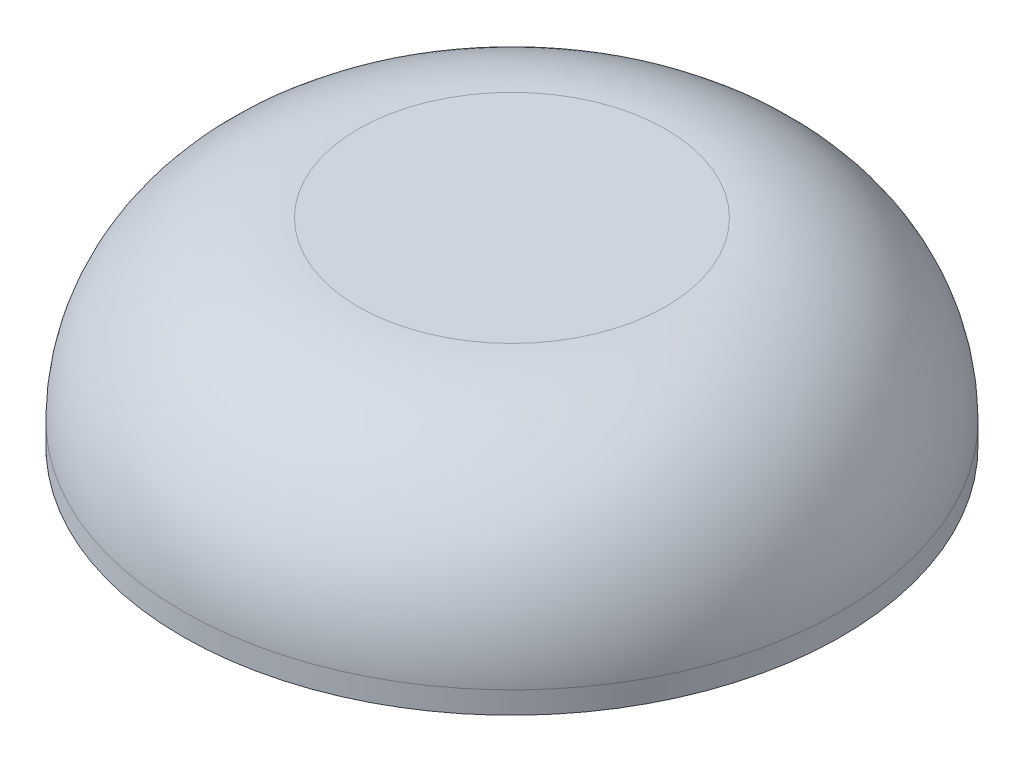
ISO-10303-21;
HEADER;
FILE_DESCRIPTION(('STEP AP214'),'2;1');
FILE_NAME('part.step','',(''),(''),'','','');
FILE_SCHEMA(('AUTOMOTIVE_DESIGN { 1 0 10303 214 1 1 1 1 }'));
ENDSEC;
DATA;
#1=APPLICATION_CONTEXT('core data for automotive mechanical design processes');
#2=APPLICATION_PROTOCOL_DEFINITION('international standard','automotive_design',2000,#1);
#3=PRODUCT_CONTEXT('',#1,'mechanical');
#4=PRODUCT('Part','Part','',(#3));
#5=PRODUCT_RELATED_PRODUCT_CATEGORY('part','',(#4));
#6=PRODUCT_DEFINITION_FORMATION('','',#4);
#7=PRODUCT_DEFINITION_CONTEXT('part definition',#1,'design');
#8=PRODUCT_DEFINITION('design','',#6,#7);
#9=PRODUCT_DEFINITION_SHAPE('','',#8);
#10=(LENGTH_UNIT() NAMED_UNIT(*) SI_UNIT(.MILLI.,.METRE.));
#11=(NAMED_UNIT(*) PLANE_ANGLE_UNIT() SI_UNIT($,.RADIAN.));
#12=(NAMED_UNIT(*) SI_UNIT($,.STERADIAN.) SOLID_ANGLE_UNIT());
#13=UNCERTAINTY_MEASURE_WITH_UNIT(LENGTH_MEASURE(1.E-05),#10,'distance_accuracy_value','');
#14=(GEOMETRIC_REPRESENTATION_CONTEXT(3) GLOBAL_UNCERTAINTY_ASSIGNED_CONTEXT((#13)) GLOBAL_UNIT_ASSIGNED_CONTEXT((#10,
#11,#12)) REPRESENTATION_CONTEXT('',''));
#15=CARTESIAN_POINT('',(0.,0.,0.));
#16=DIRECTION('',(0.,0.,1.));
#17=DIRECTION('',(1.,0.,0.));
#18=AXIS2_PLACEMENT_3D('',#15,#16,#17);
#19=CARTESIAN_POINT('',(0.,4.5,0.));
#20=DIRECTION('',(0.,-1.,0.));
#21=DIRECTION('',(0.,0.,-1.));
#22=AXIS2_PLACEMENT_3D('',#19,#20,#21);
#23=CYLINDRICAL_SURFACE('',#22,7.5);
#24=CARTESIAN_POINT('',(0.,0.5,0.));
#25=DIRECTION('',(0.,1.,0.));
#26=DIRECTION('',(0.,0.,1.));
#27=AXIS2_PLACEMENT_3D('',#24,#25,#26);
#28=CIRCLE('',#27,7.5);
#29=CARTESIAN_POINT('',(0.,0.5,7.5));
#30=VERTEX_POINT('',#29);
#31=EDGE_CURVE('E10',#30,#30,#28,.F.);
#32=ORIENTED_EDGE('',*,*,#31,.T.);
#33=EDGE_LOOP('',(#32));
#34=FACE_BOUND('',#33,.T.);
#35=CARTESIAN_POINT('',(0.,0.,0.));
#36=DIRECTION('',(0.,1.,0.));
#37=DIRECTION('',(0.,0.,1.));
#38=AXIS2_PLACEMENT_3D('',#35,#36,#37);
#39=CIRCLE('',#38,7.5);
#40=CARTESIAN_POINT('',(0.,0.,7.5));
#41=VERTEX_POINT('',#40);
#42=EDGE_CURVE('E34',#41,#41,#39,.T.);
#43=ORIENTED_EDGE('',*,*,#42,.T.);
#44=EDGE_LOOP('',(#43));
#45=FACE_BOUND('',#44,.T.);
#46=ADVANCED_FACE('F24',(#34,#45),#23,.T.);
#47=CARTESIAN_POINT('',(0.,4.5,0.));
#48=DIRECTION('',(0.,1.,0.));
#49=DIRECTION('',(0.,0.,1.));
#50=AXIS2_PLACEMENT_3D('',#47,#48,#49);
#51=PLANE('',#50);
#52=CARTESIAN_POINT('',(0.,4.5,0.));
#53=DIRECTION('',(0.,1.,0.));
#54=DIRECTION('',(0.,0.,1.));
#55=AXIS2_PLACEMENT_3D('',#52,#53,#54);
#56=CIRCLE('',#55,3.5);
#57=CARTESIAN_POINT('',(0.,4.5,3.5));
#58=VERTEX_POINT('',#57);
#59=EDGE_CURVE('E30',#58,#58,#56,.T.);
#60=ORIENTED_EDGE('',*,*,#59,.T.);
#61=EDGE_LOOP('',(#60));
#62=FACE_BOUND('',#61,.T.);
#63=ADVANCED_FACE('F45',(#62),#51,.T.);
#64=CARTESIAN_POINT('',(0.,0.,0.));
#65=DIRECTION('',(0.,1.,0.));
#66=DIRECTION('',(0.,0.,1.));
#67=AXIS2_PLACEMENT_3D('',#64,#65,#66);
#68=PLANE('',#67);
#69=ORIENTED_EDGE('',*,*,#42,.F.);
#70=EDGE_LOOP('',(#69));
#71=FACE_BOUND('',#70,.T.);
#72=ADVANCED_FACE('F42',(#71),#68,.F.);
#73=CARTESIAN_POINT('',(0.,0.5,0.));
#74=DIRECTION('',(0.,1.,0.));
#75=DIRECTION('',(0.,0.,1.));
#76=AXIS2_PLACEMENT_3D('',#73,#74,#75);
#77=DEGENERATE_TOROIDAL_SURFACE('',#76,3.5,4.,.T.);
#78=ORIENTED_EDGE('',*,*,#31,.F.);
#79=EDGE_LOOP('',(#78));
#80=FACE_BOUND('',#79,.T.);
#81=ORIENTED_EDGE('',*,*,#59,.F.);
#82=EDGE_LOOP('',(#81));
#83=FACE_BOUND('',#82,.T.);
#84=ADVANCED_FACE('F44',(#80,#83),#77,.T.);
#85=CLOSED_SHELL('',(#46,#63,#72,#84));
#86=MANIFOLD_SOLID_BREP('B2',#85);
#87=ADVANCED_BREP_SHAPE_REPRESENTATION('',(#18,#86),#14);
#88=SHAPE_DEFINITION_REPRESENTATION(#9,#87);
ENDSEC;
END-ISO-10303-21;
